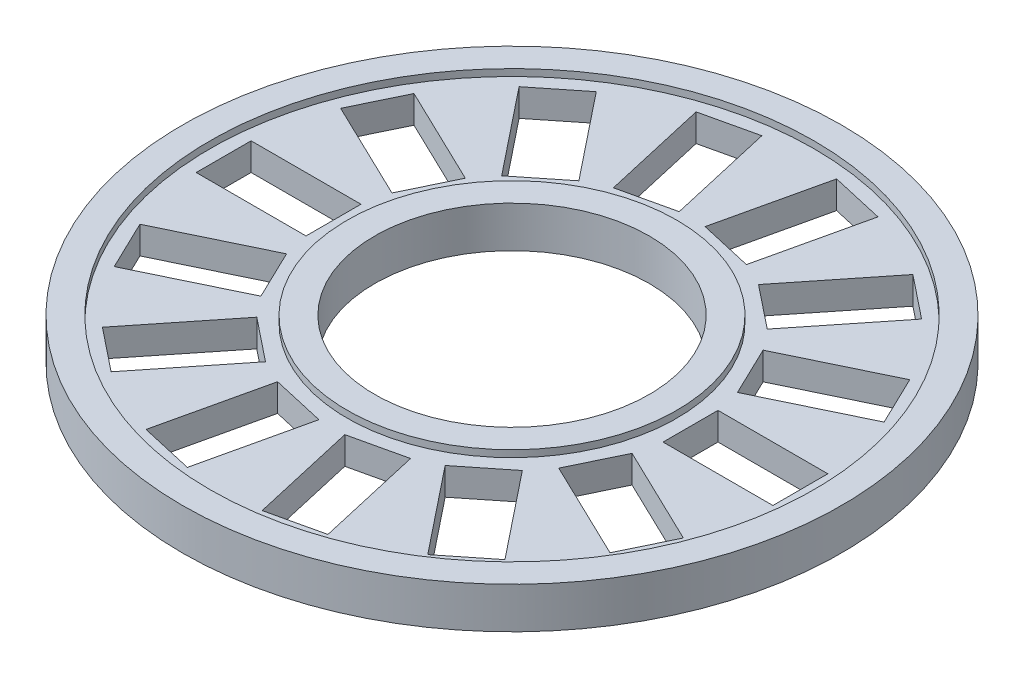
from build123d import *

# Parameters (mm, degrees)
ESQUISSE2_W                  = 4
ESQUISSE2_H                  = 2
ENL_V_MAT_EXTRU_1_DEPTH      = 18.016536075
R_P_TITION_CIRCULAIRE1_COUNT = 14


with BuildPart() as part:
    # Esquisse1 → Base-R_volution (revolve)
    with BuildSketch(Plane.XY, mode=Mode.PRIVATE) as base_r_volution_sk:
        Polygon((5, 0), (5, 1.5), (6, 1.5), (6, 1.25), (11, 1.25), (11, 1.5), (12, 1.5), (12, 0), (11, 0), (11, 0.25), (6, 0.25), (6, 0), align=None)
    revolve(base_r_volution_sk.sketch.rotate(Axis((0, 0, 0), (0, 1, 0)), 90), axis=Axis((0, 0, 0), (0, 1, 0)))

    # Esquisse2 → Enl_v. mat.-Extru.1 (cut, through all)
    with BuildSketch(Plane(origin=(0, 1.25, 0), x_dir=(-1, 0, 0), z_dir=(0, 1, 0))):
        with Locations((8.5, 0)):
            Rectangle(ESQUISSE2_W, ESQUISSE2_H)
    enl_v_mat_extru_1 = extrude(amount=-ENL_V_MAT_EXTRU_1_DEPTH, mode=Mode.SUBTRACT)

    # R_p_tition circulaire1: Enl_v. mat.-Extru.1 ×14 about axis
    r_p_tition_circulaire1_axis = Axis((0, 0, 0), (0, 1, 0))
    for i in range(1, R_P_TITION_CIRCULAIRE1_COUNT):
        add(enl_v_mat_extru_1.rotate(r_p_tition_circulaire1_axis, i * 360 / R_P_TITION_CIRCULAIRE1_COUNT), mode=Mode.SUBTRACT)


solid = part.part
